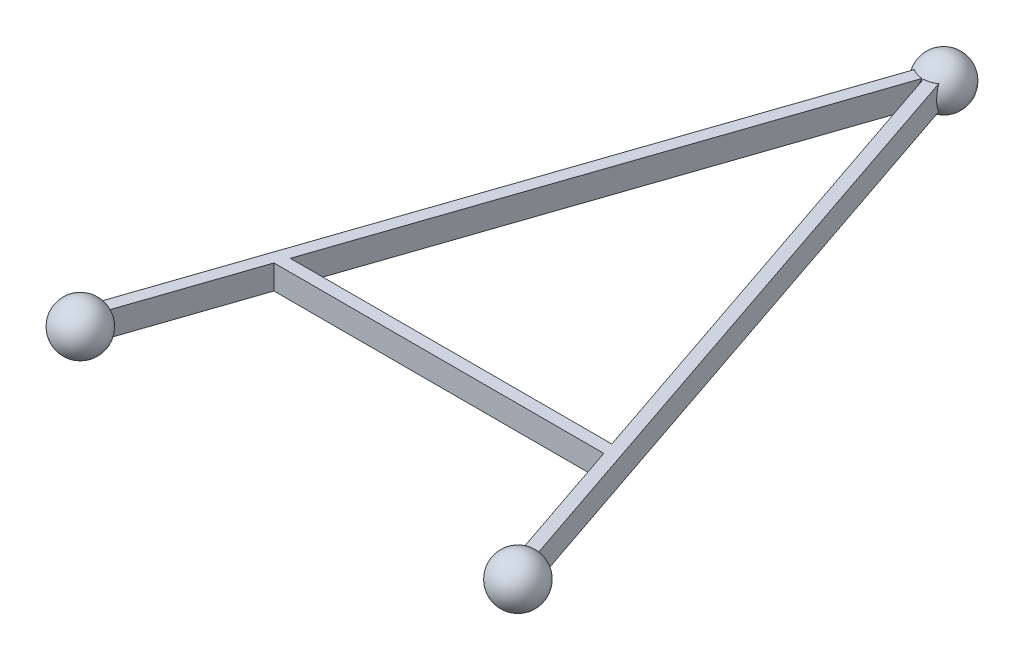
ISO-10303-21;
HEADER;
FILE_DESCRIPTION(('STEP AP214'),'2;1');
FILE_NAME('part.step','',(''),(''),'','','');
FILE_SCHEMA(('AUTOMOTIVE_DESIGN { 1 0 10303 214 1 1 1 1 }'));
ENDSEC;
DATA;
#1=APPLICATION_CONTEXT('core data for automotive mechanical design processes');
#2=APPLICATION_PROTOCOL_DEFINITION('international standard','automotive_design',2000,#1);
#3=PRODUCT_CONTEXT('',#1,'mechanical');
#4=PRODUCT('Part','Part','',(#3));
#5=PRODUCT_RELATED_PRODUCT_CATEGORY('part','',(#4));
#6=PRODUCT_DEFINITION_FORMATION('','',#4);
#7=PRODUCT_DEFINITION_CONTEXT('part definition',#1,'design');
#8=PRODUCT_DEFINITION('design','',#6,#7);
#9=PRODUCT_DEFINITION_SHAPE('','',#8);
#10=(LENGTH_UNIT() NAMED_UNIT(*) SI_UNIT(.MILLI.,.METRE.));
#11=(NAMED_UNIT(*) PLANE_ANGLE_UNIT() SI_UNIT($,.RADIAN.));
#12=(NAMED_UNIT(*) SI_UNIT($,.STERADIAN.) SOLID_ANGLE_UNIT());
#13=UNCERTAINTY_MEASURE_WITH_UNIT(LENGTH_MEASURE(1.E-05),#10,'distance_accuracy_value','');
#14=(GEOMETRIC_REPRESENTATION_CONTEXT(3) GLOBAL_UNCERTAINTY_ASSIGNED_CONTEXT((#13)) GLOBAL_UNIT_ASSIGNED_CONTEXT((#10,
#11,#12)) REPRESENTATION_CONTEXT('',''));
#15=CARTESIAN_POINT('',(0.,0.,0.));
#16=DIRECTION('',(0.,0.,1.));
#17=DIRECTION('',(1.,0.,0.));
#18=AXIS2_PLACEMENT_3D('',#15,#16,#17);
#19=CARTESIAN_POINT('',(-134.293615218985,6.35,-385.753408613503));
#20=DIRECTION('',(0.946933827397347,0.,-0.321428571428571));
#21=DIRECTION('',(-0.321428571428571,0.,-0.946933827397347));
#22=AXIS2_PLACEMENT_3D('',#19,#20,#21);
#23=PLANE('',#22);
#24=DIRECTION('',(0.321428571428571,0.,0.946933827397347));
#25=VECTOR('',#24,1.);
#26=CARTESIAN_POINT('',(-134.293615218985,6.35,-385.753408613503));
#27=LINE('',#26,#25);
#28=CARTESIAN_POINT('',(-28.1406373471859,6.35,-73.0250000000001));
#29=VERTEX_POINT('',#28);
#30=CARTESIAN_POINT('',(-6.39124895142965,6.35,-8.95094614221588));
#31=VERTEX_POINT('',#30);
#32=EDGE_CURVE('E55',#29,#31,#27,.T.);
#33=ORIENTED_EDGE('',*,*,#32,.F.);
#34=DIRECTION('',(0.,-1.,0.));
#35=VECTOR('',#34,1.);
#36=CARTESIAN_POINT('',(-28.1406373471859,6.35,-73.025));
#37=LINE('',#36,#35);
#38=CARTESIAN_POINT('',(-28.1406373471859,-6.35000000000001,-73.0249999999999));
#39=VERTEX_POINT('',#38);
#40=EDGE_CURVE('E170',#29,#39,#37,.T.);
#41=ORIENTED_EDGE('',*,*,#40,.T.);
#42=DIRECTION('',(0.321428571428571,0.,0.946933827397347));
#43=VECTOR('',#42,1.);
#44=CARTESIAN_POINT('',(-134.293615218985,-6.35,-385.753408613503));
#45=LINE('',#44,#43);
#46=CARTESIAN_POINT('',(-6.39124895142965,-6.35,-8.95094614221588));
#47=VERTEX_POINT('',#46);
#48=EDGE_CURVE('E180',#39,#47,#45,.T.);
#49=ORIENTED_EDGE('',*,*,#48,.T.);
#50=CARTESIAN_POINT('',(-3.0065149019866,0.,1.02053571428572));
#51=DIRECTION('',(0.946933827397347,0.,-0.321428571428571));
#52=DIRECTION('',(-0.321428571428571,0.,-0.946933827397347));
#53=AXIS2_PLACEMENT_3D('',#50,#51,#52);
#54=CIRCLE('',#53,12.2967221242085);
#55=EDGE_CURVE('E203',#31,#47,#54,.F.);
#56=ORIENTED_EDGE('',*,*,#55,.F.);
#57=EDGE_LOOP('',(#33,#41,#49,#56));
#58=FACE_BOUND('',#57,.T.);
#59=ADVANCED_FACE('F32',(#58),#23,.F.);
#60=CARTESIAN_POINT('',(-94.3063847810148,6.35,-385.753408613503));
#61=DIRECTION('',(0.946933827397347,0.,0.321428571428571));
#62=DIRECTION('',(0.321428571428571,0.,-0.946933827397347));
#63=AXIS2_PLACEMENT_3D('',#60,#61,#62);
#64=PLANE('',#63);
#65=DIRECTION('',(0.,1.,0.));
#66=VECTOR('',#65,1.);
#67=CARTESIAN_POINT('',(-200.459362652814,6.34999999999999,-73.025));
#68=LINE('',#67,#66);
#69=CARTESIAN_POINT('',(-200.459362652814,-6.35,-73.0249999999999));
#70=VERTEX_POINT('',#69);
#71=CARTESIAN_POINT('',(-200.459362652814,6.34999999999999,-73.025));
#72=VERTEX_POINT('',#71);
#73=EDGE_CURVE('E142',#70,#72,#68,.T.);
#74=ORIENTED_EDGE('',*,*,#73,.T.);
#75=DIRECTION('',(-0.321428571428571,0.,0.946933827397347));
#76=VECTOR('',#75,1.);
#77=CARTESIAN_POINT('',(-94.3063847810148,6.35,-385.753408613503));
#78=LINE('',#77,#76);
#79=CARTESIAN_POINT('',(-222.20875104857,6.35,-8.95094614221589));
#80=VERTEX_POINT('',#79);
#81=EDGE_CURVE('E165',#72,#80,#78,.T.);
#82=ORIENTED_EDGE('',*,*,#81,.T.);
#83=CARTESIAN_POINT('',(-225.593485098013,0.,1.02053571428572));
#84=DIRECTION('',(0.946933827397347,0.,0.321428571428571));
#85=DIRECTION('',(0.321428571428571,0.,-0.946933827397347));
#86=AXIS2_PLACEMENT_3D('',#83,#84,#85);
#87=CIRCLE('',#86,12.2967221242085);
#88=CARTESIAN_POINT('',(-222.20875104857,-6.35,-8.95094614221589));
#89=VERTEX_POINT('',#88);
#90=EDGE_CURVE('E152',#89,#80,#87,.T.);
#91=ORIENTED_EDGE('',*,*,#90,.F.);
#92=DIRECTION('',(-0.321428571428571,0.,0.946933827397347));
#93=VECTOR('',#92,1.);
#94=CARTESIAN_POINT('',(-94.3063847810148,-6.35,-385.753408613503));
#95=LINE('',#94,#93);
#96=EDGE_CURVE('E149',#70,#89,#95,.T.);
#97=ORIENTED_EDGE('',*,*,#96,.F.);
#98=EDGE_LOOP('',(#74,#82,#91,#97));
#99=FACE_BOUND('',#98,.T.);
#100=ADVANCED_FACE('F232',(#99),#64,.T.);
#101=CARTESIAN_POINT('',(-134.293615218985,-6.35,-385.753408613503));
#102=DIRECTION('',(0.,1.,0.));
#103=DIRECTION('',(-1.,0.,0.));
#104=AXIS2_PLACEMENT_3D('',#101,#102,#103);
#105=PLANE('',#104);
#106=DIRECTION('',(1.,0.,0.));
#107=VECTOR('',#106,1.);
#108=CARTESIAN_POINT('',(-213.978524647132,-6.35000000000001,-79.375));
#109=LINE('',#108,#107);
#110=CARTESIAN_POINT('',(-198.303909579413,-6.35000000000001,-79.375));
#111=VERTEX_POINT('',#110);
#112=CARTESIAN_POINT('',(-30.2960904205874,-6.35,-79.375));
#113=VERTEX_POINT('',#112);
#114=EDGE_CURVE('E121',#111,#113,#109,.T.);
#115=ORIENTED_EDGE('',*,*,#114,.T.);
#116=CARTESIAN_POINT('',(-113.921780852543,-6.35,-325.737651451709));
#117=VERTEX_POINT('',#116);
#118=EDGE_CURVE('E47',#117,#113,#45,.T.);
#119=ORIENTED_EDGE('',*,*,#118,.F.);
#120=CARTESIAN_POINT('',(-114.3,-6.35,-336.729669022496));
#121=DIRECTION('',(0.,1.,0.));
#122=DIRECTION('',(-1.,0.,0.));
#123=AXIS2_PLACEMENT_3D('',#120,#121,#122);
#124=CIRCLE('',#123,10.9985226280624);
#125=CARTESIAN_POINT('',(-107.90875104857,-6.35,-327.778722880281));
#126=VERTEX_POINT('',#125);
#127=EDGE_CURVE('E191',#126,#117,#124,.F.);
#128=ORIENTED_EDGE('',*,*,#127,.F.);
#129=DIRECTION('',(0.321428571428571,0.,0.946933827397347));
#130=VECTOR('',#129,1.);
#131=CARTESIAN_POINT('',(-128.280585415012,-6.35,-387.794480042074));
#132=LINE('',#131,#130);
#133=CARTESIAN_POINT('',(-0.378219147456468,-6.35,-10.9920175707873));
#134=VERTEX_POINT('',#133);
#135=EDGE_CURVE('E193',#126,#134,#132,.T.);
#136=ORIENTED_EDGE('',*,*,#135,.T.);
#137=CARTESIAN_POINT('',(0.,-6.35,0.));
#138=DIRECTION('',(0.,1.,0.));
#139=DIRECTION('',(-1.,0.,0.));
#140=AXIS2_PLACEMENT_3D('',#137,#138,#139);
#141=CIRCLE('',#140,10.9985226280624);
#142=EDGE_CURVE('E11',#47,#134,#141,.F.);
#143=ORIENTED_EDGE('',*,*,#142,.F.);
#144=ORIENTED_EDGE('',*,*,#48,.F.);
#145=DIRECTION('',(1.,0.,0.));
#146=VECTOR('',#145,1.);
#147=CARTESIAN_POINT('',(-213.978524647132,-6.35000000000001,-73.025));
#148=LINE('',#147,#146);
#149=EDGE_CURVE('E131',#70,#39,#148,.T.);
#150=ORIENTED_EDGE('',*,*,#149,.F.);
#151=ORIENTED_EDGE('',*,*,#96,.T.);
#152=CARTESIAN_POINT('',(-228.6,-6.35,0.));
#153=DIRECTION('',(0.,-1.,0.));
#154=DIRECTION('',(0.,0.,-1.));
#155=AXIS2_PLACEMENT_3D('',#152,#153,#154);
#156=CIRCLE('',#155,10.9985226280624);
#157=CARTESIAN_POINT('',(-228.221780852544,-6.35,-10.9920175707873));
#158=VERTEX_POINT('',#157);
#159=EDGE_CURVE('E148',#158,#89,#156,.T.);
#160=ORIENTED_EDGE('',*,*,#159,.F.);
#161=DIRECTION('',(-0.321428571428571,0.,0.946933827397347));
#162=VECTOR('',#161,1.);
#163=CARTESIAN_POINT('',(-100.319414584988,-6.35,-387.794480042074));
#164=LINE('',#163,#162);
#165=CARTESIAN_POINT('',(-120.69124895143,-6.35,-327.778722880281));
#166=VERTEX_POINT('',#165);
#167=EDGE_CURVE('E157',#166,#158,#164,.T.);
#168=ORIENTED_EDGE('',*,*,#167,.F.);
#169=CARTESIAN_POINT('',(-114.3,-6.35,-336.729669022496));
#170=DIRECTION('',(0.,-1.,0.));
#171=DIRECTION('',(0.,0.,-1.));
#172=AXIS2_PLACEMENT_3D('',#169,#170,#171);
#173=CIRCLE('',#172,10.9985226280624);
#174=CARTESIAN_POINT('',(-114.678219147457,-6.35,-325.737651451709));
#175=VERTEX_POINT('',#174);
#176=EDGE_CURVE('E147',#166,#175,#173,.F.);
#177=ORIENTED_EDGE('',*,*,#176,.T.);
#178=EDGE_CURVE('E138',#175,#111,#95,.T.);
#179=ORIENTED_EDGE('',*,*,#178,.T.);
#180=EDGE_LOOP('',(#115,#119,#128,#136,#143,#144,#150,#151,#160,#168,#177,#179));
#181=FACE_BOUND('',#180,.T.);
#182=ADVANCED_FACE('F145',(#181),#105,.F.);
#183=CARTESIAN_POINT('',(-128.280585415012,6.35,-387.794480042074));
#184=DIRECTION('',(-0.946933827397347,0.,0.321428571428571));
#185=DIRECTION('',(0.321428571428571,0.,0.946933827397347));
#186=AXIS2_PLACEMENT_3D('',#183,#184,#185);
#187=PLANE('',#186);
#188=CARTESIAN_POINT('',(3.00651490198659,0.,-1.02053571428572));
#189=DIRECTION('',(-0.946933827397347,0.,0.321428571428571));
#190=DIRECTION('',(0.321428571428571,0.,0.946933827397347));
#191=AXIS2_PLACEMENT_3D('',#188,#189,#190);
#192=CIRCLE('',#191,12.2967221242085);
#193=CARTESIAN_POINT('',(-0.378219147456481,6.35,-10.9920175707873));
#194=VERTEX_POINT('',#193);
#195=EDGE_CURVE('E40',#134,#194,#192,.F.);
#196=ORIENTED_EDGE('',*,*,#195,.F.);
#197=ORIENTED_EDGE('',*,*,#135,.F.);
#198=CARTESIAN_POINT('',(-111.293485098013,0.,-337.750204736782));
#199=DIRECTION('',(-0.946933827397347,0.,0.321428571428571));
#200=DIRECTION('',(0.321428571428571,0.,0.946933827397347));
#201=AXIS2_PLACEMENT_3D('',#198,#199,#200);
#202=CIRCLE('',#201,12.2967221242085);
#203=CARTESIAN_POINT('',(-107.90875104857,6.35,-327.778722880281));
#204=VERTEX_POINT('',#203);
#205=EDGE_CURVE('E181',#204,#126,#202,.F.);
#206=ORIENTED_EDGE('',*,*,#205,.F.);
#207=DIRECTION('',(0.321428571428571,0.,0.946933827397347));
#208=VECTOR('',#207,1.);
#209=CARTESIAN_POINT('',(-128.280585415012,6.35,-387.794480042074));
#210=LINE('',#209,#208);
#211=EDGE_CURVE('E196',#204,#194,#210,.T.);
#212=ORIENTED_EDGE('',*,*,#211,.T.);
#213=EDGE_LOOP('',(#196,#197,#206,#212));
#214=FACE_BOUND('',#213,.T.);
#215=ADVANCED_FACE('F212',(#214),#187,.F.);
#216=CARTESIAN_POINT('',(-134.293615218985,6.35,-385.753408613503));
#217=DIRECTION('',(0.,-1.,0.));
#218=DIRECTION('',(1.,0.,0.));
#219=AXIS2_PLACEMENT_3D('',#216,#217,#218);
#220=PLANE('',#219);
#221=DIRECTION('',(1.,0.,0.));
#222=VECTOR('',#221,1.);
#223=CARTESIAN_POINT('',(-213.978524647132,6.34999999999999,-73.025));
#224=LINE('',#223,#222);
#225=EDGE_CURVE('E143',#72,#29,#224,.T.);
#226=ORIENTED_EDGE('',*,*,#225,.T.);
#227=ORIENTED_EDGE('',*,*,#32,.T.);
#228=CARTESIAN_POINT('',(0.,6.35,0.));
#229=DIRECTION('',(0.,-1.,0.));
#230=DIRECTION('',(1.,0.,0.));
#231=AXIS2_PLACEMENT_3D('',#228,#229,#230);
#232=CIRCLE('',#231,10.9985226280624);
#233=EDGE_CURVE('E206',#194,#31,#232,.F.);
#234=ORIENTED_EDGE('',*,*,#233,.F.);
#235=ORIENTED_EDGE('',*,*,#211,.F.);
#236=CARTESIAN_POINT('',(-114.3,6.35,-336.729669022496));
#237=DIRECTION('',(0.,-1.,0.));
#238=DIRECTION('',(1.,0.,0.));
#239=AXIS2_PLACEMENT_3D('',#236,#237,#238);
#240=CIRCLE('',#239,10.9985226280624);
#241=CARTESIAN_POINT('',(-113.921780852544,6.35,-325.737651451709));
#242=VERTEX_POINT('',#241);
#243=EDGE_CURVE('E184',#242,#204,#240,.F.);
#244=ORIENTED_EDGE('',*,*,#243,.F.);
#245=CARTESIAN_POINT('',(-30.2960904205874,6.35,-79.3750000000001));
#246=VERTEX_POINT('',#245);
#247=EDGE_CURVE('E185',#242,#246,#27,.T.);
#248=ORIENTED_EDGE('',*,*,#247,.T.);
#249=DIRECTION('',(1.,0.,0.));
#250=VECTOR('',#249,1.);
#251=CARTESIAN_POINT('',(-213.978524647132,6.34999999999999,-79.375));
#252=LINE('',#251,#250);
#253=CARTESIAN_POINT('',(-198.303909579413,6.34999999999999,-79.375));
#254=VERTEX_POINT('',#253);
#255=EDGE_CURVE('E130',#254,#246,#252,.T.);
#256=ORIENTED_EDGE('',*,*,#255,.F.);
#257=CARTESIAN_POINT('',(-114.678219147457,6.35000000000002,-325.737651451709));
#258=VERTEX_POINT('',#257);
#259=EDGE_CURVE('E141',#258,#254,#78,.T.);
#260=ORIENTED_EDGE('',*,*,#259,.F.);
#261=CARTESIAN_POINT('',(-114.3,6.35,-336.729669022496));
#262=DIRECTION('',(0.,1.,0.));
#263=DIRECTION('',(0.,0.,1.));
#264=AXIS2_PLACEMENT_3D('',#261,#262,#263);
#265=CIRCLE('',#264,10.9985226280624);
#266=CARTESIAN_POINT('',(-120.69124895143,6.35,-327.778722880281));
#267=VERTEX_POINT('',#266);
#268=EDGE_CURVE('E160',#258,#267,#265,.F.);
#269=ORIENTED_EDGE('',*,*,#268,.T.);
#270=DIRECTION('',(-0.321428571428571,0.,0.946933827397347));
#271=VECTOR('',#270,1.);
#272=CARTESIAN_POINT('',(-100.319414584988,6.35,-387.794480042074));
#273=LINE('',#272,#271);
#274=CARTESIAN_POINT('',(-228.221780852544,6.35,-10.9920175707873));
#275=VERTEX_POINT('',#274);
#276=EDGE_CURVE('E166',#267,#275,#273,.T.);
#277=ORIENTED_EDGE('',*,*,#276,.T.);
#278=CARTESIAN_POINT('',(-228.6,6.35,0.));
#279=DIRECTION('',(0.,1.,0.));
#280=DIRECTION('',(0.,0.,1.));
#281=AXIS2_PLACEMENT_3D('',#278,#279,#280);
#282=CIRCLE('',#281,10.9985226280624);
#283=EDGE_CURVE('E174',#80,#275,#282,.T.);
#284=ORIENTED_EDGE('',*,*,#283,.F.);
#285=ORIENTED_EDGE('',*,*,#81,.F.);
#286=EDGE_LOOP('',(#226,#227,#234,#235,#244,#248,#256,#260,#269,#277,#284,#285));
#287=FACE_BOUND('',#286,.T.);
#288=ADVANCED_FACE('F220',(#287),#220,.F.);
#289=ORIENTED_EDGE('',*,*,#118,.T.);
#290=DIRECTION('',(0.,1.,0.));
#291=VECTOR('',#290,1.);
#292=CARTESIAN_POINT('',(-30.2960904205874,6.35,-79.375));
#293=LINE('',#292,#291);
#294=EDGE_CURVE('E127',#113,#246,#293,.T.);
#295=ORIENTED_EDGE('',*,*,#294,.T.);
#296=ORIENTED_EDGE('',*,*,#247,.F.);
#297=CARTESIAN_POINT('',(-117.306514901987,0.,-335.709133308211));
#298=DIRECTION('',(0.946933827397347,0.,-0.321428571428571));
#299=DIRECTION('',(-0.321428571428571,0.,-0.946933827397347));
#300=AXIS2_PLACEMENT_3D('',#297,#298,#299);
#301=CIRCLE('',#300,12.2967221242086);
#302=EDGE_CURVE('E188',#117,#242,#301,.F.);
#303=ORIENTED_EDGE('',*,*,#302,.F.);
#304=EDGE_LOOP('',(#289,#295,#296,#303));
#305=FACE_BOUND('',#304,.T.);
#306=ADVANCED_FACE('F245',(#305),#23,.F.);
#307=CARTESIAN_POINT('',(0.,0.,0.));
#308=DIRECTION('',(0.,1.,0.));
#309=DIRECTION('',(1.,0.,0.));
#310=AXIS2_PLACEMENT_3D('',#307,#308,#309);
#311=SPHERICAL_SURFACE('',#310,12.7);
#312=ORIENTED_EDGE('',*,*,#55,.T.);
#313=ORIENTED_EDGE('',*,*,#142,.T.);
#314=ORIENTED_EDGE('',*,*,#195,.T.);
#315=ORIENTED_EDGE('',*,*,#233,.T.);
#316=EDGE_LOOP('',(#312,#313,#314,#315));
#317=FACE_BOUND('',#316,.T.);
#318=ADVANCED_FACE('F34',(#317),#311,.T.);
#319=CARTESIAN_POINT('',(-114.3,0.,-336.729669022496));
#320=DIRECTION('',(0.,-1.,0.));
#321=DIRECTION('',(-0.321428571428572,0.,-0.946933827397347));
#322=AXIS2_PLACEMENT_3D('',#319,#320,#321);
#323=SPHERICAL_SURFACE('',#322,12.7);
#324=CARTESIAN_POINT('',(-117.306514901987,0.,-337.750204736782));
#325=DIRECTION('',(-0.946933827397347,0.,-0.321428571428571));
#326=DIRECTION('',(-0.321428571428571,0.,0.946933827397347));
#327=AXIS2_PLACEMENT_3D('',#324,#325,#326);
#328=CIRCLE('',#327,12.2967221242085);
#329=EDGE_CURVE('E161',#267,#166,#328,.F.);
#330=ORIENTED_EDGE('',*,*,#329,.F.);
#331=ORIENTED_EDGE('',*,*,#268,.F.);
#332=CARTESIAN_POINT('',(-111.293485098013,0.,-335.709133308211));
#333=DIRECTION('',(0.946933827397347,0.,0.321428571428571));
#334=DIRECTION('',(0.321428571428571,0.,-0.946933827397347));
#335=AXIS2_PLACEMENT_3D('',#332,#333,#334);
#336=CIRCLE('',#335,12.2967221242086);
#337=EDGE_CURVE('E163',#175,#258,#336,.F.);
#338=ORIENTED_EDGE('',*,*,#337,.F.);
#339=ORIENTED_EDGE('',*,*,#176,.F.);
#340=EDGE_LOOP('',(#330,#331,#338,#339));
#341=FACE_BOUND('',#340,.T.);
#342=ORIENTED_EDGE('',*,*,#205,.T.);
#343=ORIENTED_EDGE('',*,*,#127,.T.);
#344=ORIENTED_EDGE('',*,*,#302,.T.);
#345=ORIENTED_EDGE('',*,*,#243,.T.);
#346=EDGE_LOOP('',(#342,#343,#344,#345));
#347=FACE_BOUND('',#346,.T.);
#348=ADVANCED_FACE('F216',(#341,#347),#323,.T.);
#349=CARTESIAN_POINT('',(-100.319414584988,6.35,-387.794480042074));
#350=DIRECTION('',(-0.946933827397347,0.,-0.321428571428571));
#351=DIRECTION('',(-0.321428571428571,0.,0.946933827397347));
#352=AXIS2_PLACEMENT_3D('',#349,#350,#351);
#353=PLANE('',#352);
#354=CARTESIAN_POINT('',(-231.606514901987,0.,-1.02053571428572));
#355=DIRECTION('',(-0.946933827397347,0.,-0.321428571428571));
#356=DIRECTION('',(-0.321428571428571,0.,0.946933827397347));
#357=AXIS2_PLACEMENT_3D('',#354,#355,#356);
#358=CIRCLE('',#357,12.2967221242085);
#359=EDGE_CURVE('E177',#275,#158,#358,.T.);
#360=ORIENTED_EDGE('',*,*,#359,.F.);
#361=ORIENTED_EDGE('',*,*,#276,.F.);
#362=ORIENTED_EDGE('',*,*,#329,.T.);
#363=ORIENTED_EDGE('',*,*,#167,.T.);
#364=EDGE_LOOP('',(#360,#361,#362,#363));
#365=FACE_BOUND('',#364,.T.);
#366=ADVANCED_FACE('F237',(#365),#353,.T.);
#367=DIRECTION('',(0.,-1.,0.));
#368=VECTOR('',#367,1.);
#369=CARTESIAN_POINT('',(-198.303909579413,6.34999999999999,-79.375));
#370=LINE('',#369,#368);
#371=EDGE_CURVE('E125',#254,#111,#370,.T.);
#372=ORIENTED_EDGE('',*,*,#371,.T.);
#373=ORIENTED_EDGE('',*,*,#178,.F.);
#374=ORIENTED_EDGE('',*,*,#337,.T.);
#375=ORIENTED_EDGE('',*,*,#259,.T.);
#376=EDGE_LOOP('',(#372,#373,#374,#375));
#377=FACE_BOUND('',#376,.T.);
#378=ADVANCED_FACE('F136',(#377),#64,.T.);
#379=CARTESIAN_POINT('',(-228.6,0.,0.));
#380=DIRECTION('',(0.,1.,0.));
#381=DIRECTION('',(-1.,0.,0.));
#382=AXIS2_PLACEMENT_3D('',#379,#380,#381);
#383=SPHERICAL_SURFACE('',#382,12.7);
#384=ORIENTED_EDGE('',*,*,#283,.T.);
#385=ORIENTED_EDGE('',*,*,#359,.T.);
#386=ORIENTED_EDGE('',*,*,#159,.T.);
#387=ORIENTED_EDGE('',*,*,#90,.T.);
#388=EDGE_LOOP('',(#384,#385,#386,#387));
#389=FACE_BOUND('',#388,.T.);
#390=ADVANCED_FACE('F235',(#389),#383,.T.);
#391=CARTESIAN_POINT('',(-213.978524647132,6.34999999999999,-73.025));
#392=DIRECTION('',(0.,0.,1.));
#393=DIRECTION('',(1.,0.,0.));
#394=AXIS2_PLACEMENT_3D('',#391,#392,#393);
#395=PLANE('',#394);
#396=ORIENTED_EDGE('',*,*,#40,.F.);
#397=ORIENTED_EDGE('',*,*,#225,.F.);
#398=ORIENTED_EDGE('',*,*,#73,.F.);
#399=ORIENTED_EDGE('',*,*,#149,.T.);
#400=EDGE_LOOP('',(#396,#397,#398,#399));
#401=FACE_BOUND('',#400,.T.);
#402=ADVANCED_FACE('F229',(#401),#395,.T.);
#403=CARTESIAN_POINT('',(-213.978524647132,6.34999999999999,-79.375));
#404=DIRECTION('',(0.,0.,-1.));
#405=DIRECTION('',(-1.,0.,0.));
#406=AXIS2_PLACEMENT_3D('',#403,#404,#405);
#407=PLANE('',#406);
#408=ORIENTED_EDGE('',*,*,#294,.F.);
#409=ORIENTED_EDGE('',*,*,#114,.F.);
#410=ORIENTED_EDGE('',*,*,#371,.F.);
#411=ORIENTED_EDGE('',*,*,#255,.T.);
#412=EDGE_LOOP('',(#408,#409,#410,#411));
#413=FACE_BOUND('',#412,.T.);
#414=ADVANCED_FACE('F123',(#413),#407,.T.);
#415=CLOSED_SHELL('',(#59,#100,#182,#215,#288,#306,#318,#348,#366,#378,#390,#402,#414));
#416=MANIFOLD_SOLID_BREP('B2',#415);
#417=ADVANCED_BREP_SHAPE_REPRESENTATION('',(#18,#416),#14);
#418=SHAPE_DEFINITION_REPRESENTATION(#9,#417);
ENDSEC;
END-ISO-10303-21;
